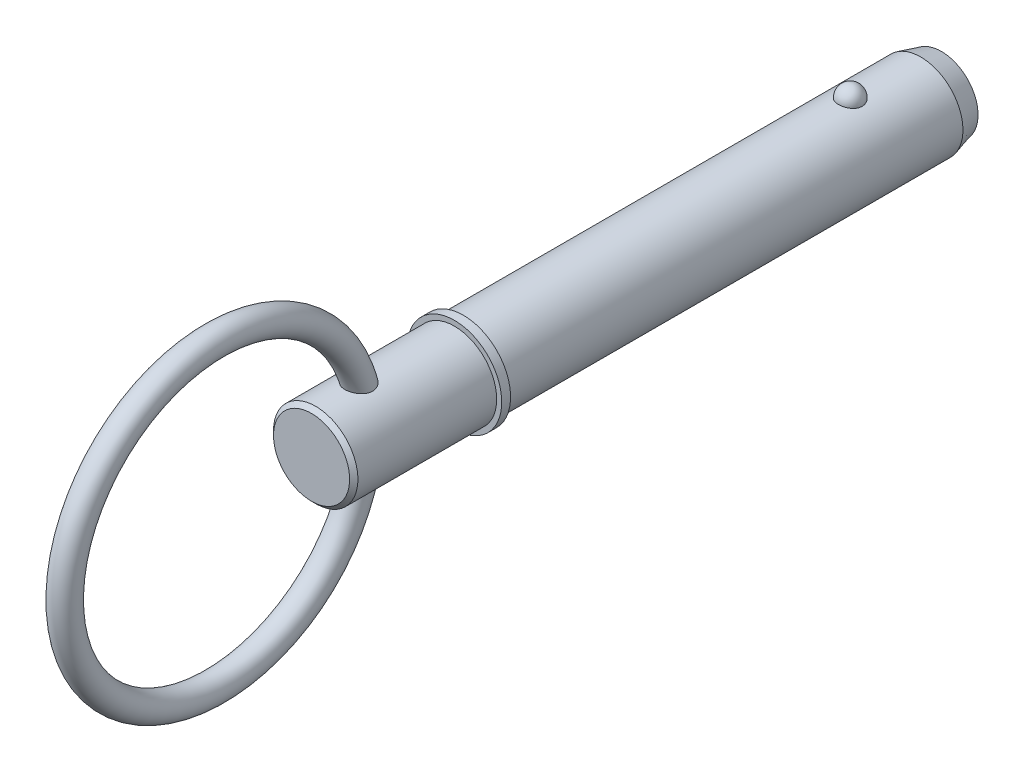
ISO-10303-21;
HEADER;
FILE_DESCRIPTION(('STEP AP214'),'2;1');
FILE_NAME('part.step','',(''),(''),'','','');
FILE_SCHEMA(('AUTOMOTIVE_DESIGN { 1 0 10303 214 1 1 1 1 }'));
ENDSEC;
DATA;
#1=APPLICATION_CONTEXT('core data for automotive mechanical design processes');
#2=APPLICATION_PROTOCOL_DEFINITION('international standard','automotive_design',2000,#1);
#3=PRODUCT_CONTEXT('',#1,'mechanical');
#4=PRODUCT('Part','Part','',(#3));
#5=PRODUCT_RELATED_PRODUCT_CATEGORY('part','',(#4));
#6=PRODUCT_DEFINITION_FORMATION('','',#4);
#7=PRODUCT_DEFINITION_CONTEXT('part definition',#1,'design');
#8=PRODUCT_DEFINITION('design','',#6,#7);
#9=PRODUCT_DEFINITION_SHAPE('','',#8);
#10=(LENGTH_UNIT() NAMED_UNIT(*) SI_UNIT(.MILLI.,.METRE.));
#11=(NAMED_UNIT(*) PLANE_ANGLE_UNIT() SI_UNIT($,.RADIAN.));
#12=(NAMED_UNIT(*) SI_UNIT($,.STERADIAN.) SOLID_ANGLE_UNIT());
#13=UNCERTAINTY_MEASURE_WITH_UNIT(LENGTH_MEASURE(1.E-05),#10,'distance_accuracy_value','');
#14=(GEOMETRIC_REPRESENTATION_CONTEXT(3) GLOBAL_UNCERTAINTY_ASSIGNED_CONTEXT((#13)) GLOBAL_UNIT_ASSIGNED_CONTEXT((#10,
#11,#12)) REPRESENTATION_CONTEXT('',''));
#15=CARTESIAN_POINT('',(0.,0.,0.));
#16=DIRECTION('',(0.,0.,1.));
#17=DIRECTION('',(1.,0.,0.));
#18=AXIS2_PLACEMENT_3D('',#15,#16,#17);
#19=CARTESIAN_POINT('',(0.,0.,63.5));
#20=DIRECTION('',(0.,0.,-1.));
#21=DIRECTION('',(-1.,0.,0.));
#22=AXIS2_PLACEMENT_3D('',#19,#20,#21);
#23=CYLINDRICAL_SURFACE('',#22,7.145);
#24=CARTESIAN_POINT('',(1.99971637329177,6.85945766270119,-2.02));
#25=CARTESIAN_POINT('',(1.9997145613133,6.85945924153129,-1.9070973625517));
#26=CARTESIAN_POINT('',(1.99051486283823,6.86216053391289,-1.79417185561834));
#27=CARTESIAN_POINT('',(1.95393597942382,6.87266409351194,-1.57152267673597));
#28=CARTESIAN_POINT('',(1.92655029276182,6.88046818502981,-1.46180016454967));
#29=CARTESIAN_POINT('',(1.85429435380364,6.90029063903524,-1.24873107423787));
#30=CARTESIAN_POINT('',(1.80943177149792,6.91230715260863,-1.14538172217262));
#31=CARTESIAN_POINT('',(1.70333474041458,6.93921158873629,-0.947875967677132));
#32=CARTESIAN_POINT('',(1.64210059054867,6.95409945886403,-0.85371939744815));
#33=CARTESIAN_POINT('',(1.5044381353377,6.98517577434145,-0.676721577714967));
#34=CARTESIAN_POINT('',(1.42793505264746,7.00137037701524,-0.593939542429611));
#35=CARTESIAN_POINT('',(1.26189697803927,7.03319066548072,-0.442536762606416));
#36=CARTESIAN_POINT('',(1.17236198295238,7.04881635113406,-0.373916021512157));
#37=CARTESIAN_POINT('',(0.982932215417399,7.0777121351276,-0.252935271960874));
#38=CARTESIAN_POINT('',(0.883068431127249,7.09098897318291,-0.200528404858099));
#39=CARTESIAN_POINT('',(0.675560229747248,7.11375589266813,-0.113212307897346));
#40=CARTESIAN_POINT('',(0.567916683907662,7.12324639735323,-0.078301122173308));
#41=CARTESIAN_POINT('',(0.350006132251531,7.13724173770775,-0.0274707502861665));
#42=CARTESIAN_POINT('',(0.239822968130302,7.14183447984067,-0.0112162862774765));
#43=CARTESIAN_POINT('',(0.0181946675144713,7.14583597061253,0.00296794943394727));
#44=CARTESIAN_POINT('',(-0.0932503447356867,7.14524522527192,0.000899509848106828));
#45=CARTESIAN_POINT('',(-0.312527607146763,7.13899247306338,-0.0213331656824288));
#46=CARTESIAN_POINT('',(-0.420388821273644,7.13340426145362,-0.0412340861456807));
#47=CARTESIAN_POINT('',(-0.631141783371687,7.11785474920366,-0.0982040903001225));
#48=CARTESIAN_POINT('',(-0.734033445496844,7.10789337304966,-0.13527347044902));
#49=CARTESIAN_POINT('',(-0.932634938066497,7.08458058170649,-0.225826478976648));
#50=CARTESIAN_POINT('',(-1.02829911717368,7.07120963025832,-0.279405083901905));
#51=CARTESIAN_POINT('',(-1.20927180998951,7.04252043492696,-0.401457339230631));
#52=CARTESIAN_POINT('',(-1.29457925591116,7.02720199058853,-0.469932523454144));
#53=CARTESIAN_POINT('',(-1.45423311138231,6.995926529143,-0.62143818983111));
#54=CARTESIAN_POINT('',(-1.5283348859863,6.97996288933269,-0.704725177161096));
#55=CARTESIAN_POINT('',(-1.66169281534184,6.94942414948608,-0.882667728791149));
#56=CARTESIAN_POINT('',(-1.72094789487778,6.93484915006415,-0.977324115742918));
#57=CARTESIAN_POINT('',(-1.82375276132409,6.90853186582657,-1.17661373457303));
#58=CARTESIAN_POINT('',(-1.86711024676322,6.8968248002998,-1.28135093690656));
#59=CARTESIAN_POINT('',(-1.9360425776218,6.87779420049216,-1.49689986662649));
#60=CARTESIAN_POINT('',(-1.96161794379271,6.87047053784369,-1.60771141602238));
#61=CARTESIAN_POINT('',(-1.99427437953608,6.86106309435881,-1.83176258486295));
#62=CARTESIAN_POINT('',(-2.00143373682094,6.8589571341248,-1.9449898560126));
#63=CARTESIAN_POINT('',(-1.99730449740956,6.86016064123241,-2.17107603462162));
#64=CARTESIAN_POINT('',(-1.98601641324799,6.86346995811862,-2.28393495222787));
#65=CARTESIAN_POINT('',(-1.94538181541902,6.87509649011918,-2.5054843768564));
#66=CARTESIAN_POINT('',(-1.91612773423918,6.88338806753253,-2.61419321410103));
#67=CARTESIAN_POINT('',(-1.84036449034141,6.90402888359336,-2.8250124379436));
#68=CARTESIAN_POINT('',(-1.79385462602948,6.91637828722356,-2.92712255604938));
#69=CARTESIAN_POINT('',(-1.68442067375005,6.94384180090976,-3.12247704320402));
#70=CARTESIAN_POINT('',(-1.62140729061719,6.95897081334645,-3.21566929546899));
#71=CARTESIAN_POINT('',(-1.4806650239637,6.99026742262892,-3.38999412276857));
#72=CARTESIAN_POINT('',(-1.40293556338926,7.00643506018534,-3.47112622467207));
#73=CARTESIAN_POINT('',(-1.2344320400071,7.03807960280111,-3.61938672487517));
#74=CARTESIAN_POINT('',(-1.1436092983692,7.05355363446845,-3.68646046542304));
#75=CARTESIAN_POINT('',(-0.9515914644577,7.08201263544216,-3.80431973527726));
#76=CARTESIAN_POINT('',(-0.850397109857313,7.09499778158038,-3.85510642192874));
#77=CARTESIAN_POINT('',(-0.641823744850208,7.11687679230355,-3.93839532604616));
#78=CARTESIAN_POINT('',(-0.534539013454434,7.1258202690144,-3.97112042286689));
#79=CARTESIAN_POINT('',(-0.315743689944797,7.1388605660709,-4.01830716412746));
#80=CARTESIAN_POINT('',(-0.204233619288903,7.14295798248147,-4.0327710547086));
#81=CARTESIAN_POINT('',(0.0175518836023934,7.14582273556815,-4.04291389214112));
#82=CARTESIAN_POINT('',(0.127809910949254,7.14469090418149,-4.03894819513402));
#83=CARTESIAN_POINT('',(0.346044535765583,7.13745046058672,-4.01315850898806));
#84=CARTESIAN_POINT('',(0.454021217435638,7.13134203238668,-3.99133518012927));
#85=CARTESIAN_POINT('',(0.664227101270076,7.11483713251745,-3.93057164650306));
#86=CARTESIAN_POINT('',(0.766477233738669,7.10445761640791,-3.89169908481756));
#87=CARTESIAN_POINT('',(0.96292921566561,7.08050813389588,-3.79792023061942));
#88=CARTESIAN_POINT('',(1.05713054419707,7.06693796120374,-3.7430129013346));
#89=CARTESIAN_POINT('',(1.23644031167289,7.03780007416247,-3.61765173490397));
#90=CARTESIAN_POINT('',(1.32138387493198,7.0222044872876,-3.54696861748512));
#91=CARTESIAN_POINT('',(1.47830582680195,6.99085504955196,-3.39245228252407));
#92=CARTESIAN_POINT('',(1.55028198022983,6.97510117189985,-3.30861680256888));
#93=CARTESIAN_POINT('',(1.68063701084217,6.94485803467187,-3.12843058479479));
#94=CARTESIAN_POINT('',(1.73875175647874,6.93039619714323,-3.03188405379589));
#95=CARTESIAN_POINT('',(1.83823393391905,6.90467783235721,-2.83015210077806));
#96=CARTESIAN_POINT('',(1.87960712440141,6.89342020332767,-2.72496966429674));
#97=CARTESIAN_POINT('',(1.94111647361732,6.87633596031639,-2.52050234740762));
#98=CARTESIAN_POINT('',(1.96305249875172,6.87005682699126,-2.42179225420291));
#99=CARTESIAN_POINT('',(1.99235308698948,6.86161702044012,-2.22206084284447));
#100=CARTESIAN_POINT('',(1.99971799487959,6.85945624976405,-2.12103957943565));
#101=CARTESIAN_POINT('',(1.99971637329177,6.85945766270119,-2.02));
#102=B_SPLINE_CURVE_WITH_KNOTS('',3,(#24,#25,#26,#27,#28,#29,#30,#31,#32,#33,#34,#35,#36,#37,
#38,#39,#40,#41,#42,#43,#44,#45,#46,#47,#48,#49,#50,#51,#52,#53,#54,#55,#56,#57,#58,#59,#60,#61,
#62,#63,#64,#65,#66,#67,#68,#69,#70,#71,#72,#73,#74,#75,#76,#77,#78,#79,#80,#81,#82,#83,#84,#85,
#86,#87,#88,#89,#90,#91,#92,#93,#94,#95,#96,#97,#98,#99,#100,#101),.UNSPECIFIED.,.T.,.F.,(4,2,2,
2,2,2,2,2,2,2,2,2,2,2,2,2,2,2,2,2,2,2,2,2,2,2,2,2,2,2,2,2,2,2,2,2,2,2,4),(0.,0.338345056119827,
0.67681114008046,1.01512885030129,1.35344038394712,1.69345130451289,2.0334623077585,
2.37248128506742,2.71146235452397,3.04425125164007,3.37700766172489,3.70493009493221,
4.03285819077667,4.36270921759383,4.69259422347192,5.02887632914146,5.36518278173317,
5.70543263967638,6.04567253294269,6.38446363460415,6.72324532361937,7.0602984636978,
7.39736530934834,7.73629500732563,8.07523799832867,8.4154752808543,8.7556883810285,
9.09160363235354,9.42747756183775,9.75690239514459,10.0863150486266,10.4144324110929,
10.7425709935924,11.0758313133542,11.4091490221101,11.748385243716,12.0875046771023,
12.3903058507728,12.6930998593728),.UNSPECIFIED.);
#103=CARTESIAN_POINT('',(1.99971637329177,6.85945766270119,-2.02));
#104=VERTEX_POINT('',#103);
#105=EDGE_CURVE('E101',#104,#104,#102,.T.);
#106=ORIENTED_EDGE('',*,*,#105,.T.);
#107=EDGE_LOOP('',(#106));
#108=FACE_BOUND('',#107,.T.);
#109=CARTESIAN_POINT('',(0.,0.,-13.9499999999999));
#110=DIRECTION('',(0.,0.,-1.));
#111=DIRECTION('',(-1.,0.,0.));
#112=AXIS2_PLACEMENT_3D('',#109,#110,#111);
#113=CIRCLE('',#112,7.145);
#114=CARTESIAN_POINT('',(-7.145,0.,-13.9499999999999));
#115=VERTEX_POINT('',#114);
#116=EDGE_CURVE('E109',#115,#115,#113,.F.);
#117=ORIENTED_EDGE('',*,*,#116,.T.);
#118=EDGE_LOOP('',(#117));
#119=FACE_BOUND('',#118,.T.);
#120=CARTESIAN_POINT('',(0.,0.,63.5));
#121=DIRECTION('',(0.,0.,1.));
#122=DIRECTION('',(1.,0.,0.));
#123=AXIS2_PLACEMENT_3D('',#120,#121,#122);
#124=CIRCLE('',#123,7.145);
#125=CARTESIAN_POINT('',(7.145,0.,63.5));
#126=VERTEX_POINT('',#125);
#127=EDGE_CURVE('E107',#126,#126,#124,.T.);
#128=ORIENTED_EDGE('',*,*,#127,.F.);
#129=EDGE_LOOP('',(#128));
#130=FACE_BOUND('',#129,.T.);
#131=ADVANCED_FACE('F39',(#108,#119,#130),#23,.T.);
#132=CARTESIAN_POINT('',(0.,0.,-17.45));
#133=DIRECTION('',(0.,0.,-1.));
#134=DIRECTION('',(-1.,0.,0.));
#135=AXIS2_PLACEMENT_3D('',#132,#133,#134);
#136=PLANE('',#135);
#137=CARTESIAN_POINT('',(0.,0.,-17.45));
#138=DIRECTION('',(0.,0.,-1.));
#139=DIRECTION('',(-1.,0.,0.));
#140=AXIS2_PLACEMENT_3D('',#137,#138,#139);
#141=CIRCLE('',#140,6.20717782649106);
#142=CARTESIAN_POINT('',(-6.20717782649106,0.,-17.45));
#143=VERTEX_POINT('',#142);
#144=EDGE_CURVE('E143',#143,#143,#141,.T.);
#145=ORIENTED_EDGE('',*,*,#144,.T.);
#146=EDGE_LOOP('',(#145));
#147=FACE_BOUND('',#146,.T.);
#148=ADVANCED_FACE('F87',(#147),#136,.T.);
#149=CARTESIAN_POINT('',(0.,0.,-17.45));
#150=DIRECTION('',(0.,0.,1.));
#151=DIRECTION('',(1.,0.,0.));
#152=AXIS2_PLACEMENT_3D('',#149,#150,#151);
#153=CONICAL_SURFACE('',#152,6.20717782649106,0.261799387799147);
#154=ORIENTED_EDGE('',*,*,#116,.F.);
#155=EDGE_LOOP('',(#154));
#156=FACE_BOUND('',#155,.T.);
#157=ORIENTED_EDGE('',*,*,#144,.F.);
#158=EDGE_LOOP('',(#157));
#159=FACE_BOUND('',#158,.T.);
#160=ADVANCED_FACE('F93',(#156,#159),#153,.T.);
#161=CARTESIAN_POINT('',(0.,7.145,-2.02));
#162=DIRECTION('',(0.,1.,0.));
#163=DIRECTION('',(0.,0.,1.));
#164=AXIS2_PLACEMENT_3D('',#161,#162,#163);
#165=SPHERICAL_SURFACE('',#164,2.02);
#166=ORIENTED_EDGE('',*,*,#105,.F.);
#167=EDGE_LOOP('',(#166));
#168=FACE_BOUND('',#167,.T.);
#169=ADVANCED_FACE('F112',(#168),#165,.T.);
#170=CARTESIAN_POINT('',(0.,0.,63.5));
#171=DIRECTION('',(0.,0.,-1.));
#172=DIRECTION('',(-1.,0.,0.));
#173=AXIS2_PLACEMENT_3D('',#170,#171,#172);
#174=PLANE('',#173);
#175=ORIENTED_EDGE('',*,*,#127,.T.);
#176=EDGE_LOOP('',(#175));
#177=FACE_BOUND('',#176,.T.);
#178=CARTESIAN_POINT('',(0.,0.,63.5));
#179=DIRECTION('',(0.,0.,-1.));
#180=DIRECTION('',(-1.,0.,0.));
#181=AXIS2_PLACEMENT_3D('',#178,#179,#180);
#182=CIRCLE('',#181,8.);
#183=CARTESIAN_POINT('',(-8.,0.,63.5));
#184=VERTEX_POINT('',#183);
#185=EDGE_CURVE('E108',#184,#184,#182,.T.);
#186=ORIENTED_EDGE('',*,*,#185,.T.);
#187=EDGE_LOOP('',(#186));
#188=FACE_BOUND('',#187,.T.);
#189=ADVANCED_FACE('F116',(#177,#188),#174,.T.);
#190=CARTESIAN_POINT('',(0.,0.,33.7287874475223));
#191=DIRECTION('',(0.,0.,-1.));
#192=DIRECTION('',(-1.,0.,0.));
#193=AXIS2_PLACEMENT_3D('',#190,#191,#192);
#194=CYLINDRICAL_SURFACE('',#193,8.);
#195=CARTESIAN_POINT('',(0.,0.,65.));
#196=DIRECTION('',(0.,0.,-1.));
#197=DIRECTION('',(-1.,0.,0.));
#198=AXIS2_PLACEMENT_3D('',#195,#196,#197);
#199=CIRCLE('',#198,8.);
#200=CARTESIAN_POINT('',(-8.,0.,65.));
#201=VERTEX_POINT('',#200);
#202=EDGE_CURVE('E133',#201,#201,#199,.T.);
#203=ORIENTED_EDGE('',*,*,#202,.T.);
#204=EDGE_LOOP('',(#203));
#205=FACE_BOUND('',#204,.T.);
#206=ORIENTED_EDGE('',*,*,#185,.F.);
#207=EDGE_LOOP('',(#206));
#208=FACE_BOUND('',#207,.T.);
#209=ADVANCED_FACE('F120',(#205,#208),#194,.T.);
#210=CARTESIAN_POINT('',(0.,8.,65.));
#211=DIRECTION('',(0.,0.,1.));
#212=DIRECTION('',(1.,0.,0.));
#213=AXIS2_PLACEMENT_3D('',#210,#211,#212);
#214=PLANE('',#213);
#215=CARTESIAN_POINT('',(0.,0.,65.));
#216=DIRECTION('',(0.,0.,1.));
#217=DIRECTION('',(1.,0.,0.));
#218=AXIS2_PLACEMENT_3D('',#215,#216,#217);
#219=CIRCLE('',#218,7.145);
#220=CARTESIAN_POINT('',(7.145,0.,65.));
#221=VERTEX_POINT('',#220);
#222=EDGE_CURVE('E111',#221,#221,#219,.T.);
#223=ORIENTED_EDGE('',*,*,#222,.F.);
#224=EDGE_LOOP('',(#223));
#225=FACE_BOUND('',#224,.T.);
#226=ORIENTED_EDGE('',*,*,#202,.F.);
#227=EDGE_LOOP('',(#226));
#228=FACE_BOUND('',#227,.T.);
#229=ADVANCED_FACE('F84',(#225,#228),#214,.T.);
#230=CARTESIAN_POINT('',(0.,0.,89.2));
#231=DIRECTION('',(0.,0.,-1.));
#232=DIRECTION('',(-1.,0.,0.));
#233=AXIS2_PLACEMENT_3D('',#230,#231,#232);
#234=CYLINDRICAL_SURFACE('',#233,7.145);
#235=CARTESIAN_POINT('',(-1.03551034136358,-7.0695645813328,79.1302593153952));
#236=CARTESIAN_POINT('',(-0.923225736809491,-7.08601142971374,79.0744028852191));
#237=CARTESIAN_POINT('',(-0.806039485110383,-7.10042113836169,79.0278354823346));
#238=CARTESIAN_POINT('',(-0.565173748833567,-7.1236385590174,78.9542799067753));
#239=CARTESIAN_POINT('',(-0.441495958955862,-7.13244772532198,78.9272866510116));
#240=CARTESIAN_POINT('',(-0.191106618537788,-7.14354309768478,78.8934505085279));
#241=CARTESIAN_POINT('',(-0.0643945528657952,-7.14582818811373,78.886611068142));
#242=CARTESIAN_POINT('',(0.188443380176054,-7.14363337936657,78.8932414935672));
#243=CARTESIAN_POINT('',(0.314569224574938,-7.13915321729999,78.906712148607));
#244=CARTESIAN_POINT('',(0.562499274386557,-7.12390574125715,78.9536416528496));
#245=CARTESIAN_POINT('',(0.684308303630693,-7.11314569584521,78.9870773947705));
#246=CARTESIAN_POINT('',(0.920329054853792,-7.08647538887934,79.073194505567));
#247=CARTESIAN_POINT('',(1.03454038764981,-7.07056486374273,79.1258768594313));
#248=CARTESIAN_POINT('',(1.25232634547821,-7.03526161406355,79.2494470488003));
#249=CARTESIAN_POINT('',(1.35588248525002,-7.01586299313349,79.3203658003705));
#250=CARTESIAN_POINT('',(1.54916093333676,-6.9757352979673,79.4787573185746));
#251=CARTESIAN_POINT('',(1.63888414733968,-6.95500631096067,79.5662290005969));
#252=CARTESIAN_POINT('',(1.80113983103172,-6.91475703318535,79.7547277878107));
#253=CARTESIAN_POINT('',(1.8738192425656,-6.89522757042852,79.8556263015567));
#254=CARTESIAN_POINT('',(2.00091178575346,-6.85942834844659,80.06884010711));
#255=CARTESIAN_POINT('',(2.05532963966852,-6.8431577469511,80.1811524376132));
#256=CARTESIAN_POINT('',(2.14350100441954,-6.81604873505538,80.4111948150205));
#257=CARTESIAN_POINT('',(2.17770329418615,-6.80509340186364,80.5287395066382));
#258=CARTESIAN_POINT('',(2.22691394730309,-6.7891497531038,80.768149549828));
#259=CARTESIAN_POINT('',(2.2419216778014,-6.7841616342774,80.8900150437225));
#260=CARTESIAN_POINT('',(2.25313992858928,-6.78044381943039,81.1358069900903));
#261=CARTESIAN_POINT('',(2.24917302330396,-6.78177319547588,81.2597420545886));
#262=CARTESIAN_POINT('',(2.22301329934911,-6.79039131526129,81.5054389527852));
#263=CARTESIAN_POINT('',(2.20081491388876,-6.79768187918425,81.6272001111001));
#264=CARTESIAN_POINT('',(2.13702421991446,-6.81801706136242,81.8752873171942));
#265=CARTESIAN_POINT('',(2.09404815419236,-6.83146790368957,82.0012230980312));
#266=CARTESIAN_POINT('',(1.9898638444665,-6.86253672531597,82.2448244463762));
#267=CARTESIAN_POINT('',(1.9286413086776,-6.88015796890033,82.3624834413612));
#268=CARTESIAN_POINT('',(1.78274362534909,-6.91947130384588,82.5974979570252));
#269=CARTESIAN_POINT('',(1.69640701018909,-6.94139021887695,82.7137892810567));
#270=CARTESIAN_POINT('',(1.50503944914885,-6.98537683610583,82.9297996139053));
#271=CARTESIAN_POINT('',(1.40001969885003,-7.00744444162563,83.029528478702));
#272=CARTESIAN_POINT('',(1.19221781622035,-7.04548349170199,83.193170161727));
#273=CARTESIAN_POINT('',(1.09203347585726,-7.06185586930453,83.2602859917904));
#274=CARTESIAN_POINT('',(0.881607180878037,-7.09119477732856,83.377337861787));
#275=CARTESIAN_POINT('',(0.771372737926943,-7.10416382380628,83.4272866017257));
#276=CARTESIAN_POINT('',(0.542622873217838,-7.12529560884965,83.507475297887));
#277=CARTESIAN_POINT('',(0.424058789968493,-7.13342692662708,83.5375865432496));
#278=CARTESIAN_POINT('',(0.18315568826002,-7.14366628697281,83.5753706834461));
#279=CARTESIAN_POINT('',(0.0608191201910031,-7.14577815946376,83.583057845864));
#280=CARTESIAN_POINT('',(-0.169367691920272,-7.14381572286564,83.5758601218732));
#281=CARTESIAN_POINT('',(-0.277308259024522,-7.14040669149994,83.5634029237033));
#282=CARTESIAN_POINT('',(-0.489468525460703,-7.12900651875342,83.5211569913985));
#283=CARTESIAN_POINT('',(-0.593687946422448,-7.12101503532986,83.4913669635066));
#284=CARTESIAN_POINT('',(-0.796149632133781,-7.10123695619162,83.4159872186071));
#285=CARTESIAN_POINT('',(-0.894373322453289,-7.08943921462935,83.3703510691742));
#286=CARTESIAN_POINT('',(-1.08274371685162,-7.06312621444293,83.265336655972));
#287=CARTESIAN_POINT('',(-1.17288754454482,-7.04860999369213,83.2059535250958));
#288=CARTESIAN_POINT('',(-1.35484961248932,-7.01605385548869,83.0671134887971));
#289=CARTESIAN_POINT('',(-1.44541008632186,-6.99780069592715,82.9860611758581));
#290=CARTESIAN_POINT('',(-1.61364655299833,-6.96093393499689,82.8115990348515));
#291=CARTESIAN_POINT('',(-1.69131381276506,-6.94232009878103,82.7181809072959));
#292=CARTESIAN_POINT('',(-1.843300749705,-6.90364386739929,82.5066087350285));
#293=CARTESIAN_POINT('',(-1.9154309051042,-6.88377370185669,82.3868392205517));
#294=CARTESIAN_POINT('',(-2.04002946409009,-6.84788436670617,82.1368759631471));
#295=CARTESIAN_POINT('',(-2.09248830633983,-6.83186707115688,82.0066771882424));
#296=CARTESIAN_POINT('',(-2.17795964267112,-6.80511869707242,81.7325553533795));
#297=CARTESIAN_POINT('',(-2.20992909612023,-6.79467512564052,81.5882740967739));
#298=CARTESIAN_POINT('',(-2.24813111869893,-6.78213595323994,81.2959843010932));
#299=CARTESIAN_POINT('',(-2.25438316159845,-6.78003403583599,81.1479786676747));
#300=CARTESIAN_POINT('',(-2.24011368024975,-6.78475868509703,80.8654300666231));
#301=CARTESIAN_POINT('',(-2.22172362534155,-6.79087455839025,80.7307692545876));
#302=CARTESIAN_POINT('',(-2.16145328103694,-6.81029672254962,80.4673673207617));
#303=CARTESIAN_POINT('',(-2.11958615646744,-6.82359898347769,80.3386229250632));
#304=CARTESIAN_POINT('',(-2.0178412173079,-6.85433303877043,80.1022679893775));
#305=CARTESIAN_POINT('',(-1.95982394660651,-6.87131080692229,79.9937922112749));
#306=CARTESIAN_POINT('',(-1.82642155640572,-6.90796511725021,79.7885914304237));
#307=CARTESIAN_POINT('',(-1.75103235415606,-6.92764229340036,79.6918691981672));
#308=CARTESIAN_POINT('',(-1.57825515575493,-6.96911949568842,79.5054086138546));
#309=CARTESIAN_POINT('',(-1.47957996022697,-6.99096237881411,79.4168703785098));
#310=CARTESIAN_POINT('',(-1.26760341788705,-7.0324852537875,79.2588404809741));
#311=CARTESIAN_POINT('',(-1.15429989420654,-7.05216492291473,79.1893516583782));
#312=CARTESIAN_POINT('',(-1.03551034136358,-7.0695645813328,79.1302593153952));
#313=B_SPLINE_CURVE_WITH_KNOTS('',3,(#235,#236,#237,#238,#239,#240,#241,#242,#243,#244,#245,
#246,#247,#248,#249,#250,#251,#252,#253,#254,#255,#256,#257,#258,#259,#260,#261,#262,#263,#264,
#265,#266,#267,#268,#269,#270,#271,#272,#273,#274,#275,#276,#277,#278,#279,#280,#281,#282,#283,
#284,#285,#286,#287,#288,#289,#290,#291,#292,#293,#294,#295,#296,#297,#298,#299,#300,#301,#302,
#303,#304,#305,#306,#307,#308,#309,#310,#311,#312),.UNSPECIFIED.,.T.,.F.,(4,2,2,2,2,2,2,2,2,2,2,
2,2,2,2,2,2,2,2,2,2,2,2,2,2,2,2,2,2,2,2,2,2,2,2,2,2,2,4),(0.,0.378979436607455,
0.757860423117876,1.13680619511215,1.51576669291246,1.89428943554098,2.2728315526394,
2.65201969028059,3.03118299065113,3.4069461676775,3.78261210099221,4.14959041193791,
4.5165808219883,4.88700951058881,5.25755134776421,5.65713708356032,6.05703662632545,
6.49445595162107,6.93161403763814,7.29520224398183,7.65852089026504,8.02417421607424,
8.38959483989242,8.71415763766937,9.0387446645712,9.36429093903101,9.68995264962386,
10.0572255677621,10.4247462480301,10.8465602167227,11.2685789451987,11.7106604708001,
12.152407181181,12.5583067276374,12.9639788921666,13.3347314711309,13.7055712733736,
14.1064462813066,14.5073810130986),.UNSPECIFIED.);
#314=CARTESIAN_POINT('',(-1.03551034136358,-7.0695645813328,79.1302593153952));
#315=VERTEX_POINT('',#314);
#316=EDGE_CURVE('E10',#315,#315,#313,.T.);
#317=ORIENTED_EDGE('',*,*,#316,.F.);
#318=EDGE_LOOP('',(#317));
#319=FACE_BOUND('',#318,.T.);
#320=CARTESIAN_POINT('',(-1.03551034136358,7.0695645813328,79.1302593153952));
#321=CARTESIAN_POINT('',(-1.14644953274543,7.0533145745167,79.185446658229));
#322=CARTESIAN_POINT('',(-1.25260902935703,7.03507806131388,79.2497022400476));
#323=CARTESIAN_POINT('',(-1.45240021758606,6.99656564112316,79.3949589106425));
#324=CARTESIAN_POINT('',(-1.54602879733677,6.97628922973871,79.4759641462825));
#325=CARTESIAN_POINT('',(-1.71815091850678,6.93590796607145,79.6529100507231));
#326=CARTESIAN_POINT('',(-1.79663177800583,6.91580327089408,79.7488631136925));
#327=CARTESIAN_POINT('',(-1.93607718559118,6.87807159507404,79.9531625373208));
#328=CARTESIAN_POINT('',(-1.99704642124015,6.86044395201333,80.0615055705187));
#329=CARTESIAN_POINT('',(-2.09894945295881,6.82995115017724,80.2855428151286));
#330=CARTESIAN_POINT('',(-2.1402125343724,6.81700866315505,80.4010768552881));
#331=CARTESIAN_POINT('',(-2.20347311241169,6.79682602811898,80.6377588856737));
#332=CARTESIAN_POINT('',(-2.22547114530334,6.78958572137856,80.7589067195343));
#333=CARTESIAN_POINT('',(-2.25026114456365,6.78140983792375,81.0032142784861));
#334=CARTESIAN_POINT('',(-2.25306986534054,6.78046876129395,81.1263721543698));
#335=CARTESIAN_POINT('',(-2.2403056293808,6.78469532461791,81.3716049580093));
#336=CARTESIAN_POINT('',(-2.22472720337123,6.78986478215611,81.4936795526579));
#337=CARTESIAN_POINT('',(-2.17472134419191,6.8060520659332,81.7420367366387));
#338=CARTESIAN_POINT('',(-2.13910164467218,6.81743831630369,81.8680537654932));
#339=CARTESIAN_POINT('',(-2.04975058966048,6.84483151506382,82.1129736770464));
#340=CARTESIAN_POINT('',(-1.99600968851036,6.86084089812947,82.2318727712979));
#341=CARTESIAN_POINT('',(-1.86558545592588,6.8975101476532,82.4714258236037));
#342=CARTESIAN_POINT('',(-1.78715729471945,6.91847353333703,82.5910877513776));
#343=CARTESIAN_POINT('',(-1.61149373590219,6.96148580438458,82.8156460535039));
#344=CARTESIAN_POINT('',(-1.51424701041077,6.98353533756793,82.9205334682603));
#345=CARTESIAN_POINT('',(-1.30107590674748,7.02639179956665,83.1129518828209));
#346=CARTESIAN_POINT('',(-1.18492282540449,7.04717858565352,83.2002366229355));
#347=CARTESIAN_POINT('',(-0.937392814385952,7.08434208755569,83.3508275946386));
#348=CARTESIAN_POINT('',(-0.806039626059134,7.10072555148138,83.4141705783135));
#349=CARTESIAN_POINT('',(-0.550470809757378,7.12475629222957,83.5054837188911));
#350=CARTESIAN_POINT('',(-0.427643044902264,7.13327781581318,83.5370470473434));
#351=CARTESIAN_POINT('',(-0.240556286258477,7.14122488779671,83.5663563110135));
#352=CARTESIAN_POINT('',(-0.177714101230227,7.14306799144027,83.5731199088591));
#353=CARTESIAN_POINT('',(-0.0516470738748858,7.14509121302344,83.5805390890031));
#354=CARTESIAN_POINT('',(0.0115777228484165,7.14527152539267,83.5811953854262));
#355=CARTESIAN_POINT('',(0.182932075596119,7.14347436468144,83.5746165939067));
#356=CARTESIAN_POINT('',(0.290871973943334,7.13986325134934,83.5614086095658));
#357=CARTESIAN_POINT('',(0.502842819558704,7.1280769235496,83.5176904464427));
#358=CARTESIAN_POINT('',(0.606873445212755,7.11990133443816,83.4871788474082));
#359=CARTESIAN_POINT('',(0.809001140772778,7.09978218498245,83.4103786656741));
#360=CARTESIAN_POINT('',(0.907071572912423,7.08782300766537,83.3640246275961));
#361=CARTESIAN_POINT('',(1.09503957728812,7.0612282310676,83.2576208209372));
#362=CARTESIAN_POINT('',(1.18493426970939,7.04659169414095,83.1975662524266));
#363=CARTESIAN_POINT('',(1.36644041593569,7.01380352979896,83.0572339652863));
#364=CARTESIAN_POINT('',(1.45676563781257,6.99544216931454,82.9753442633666));
#365=CARTESIAN_POINT('',(1.6244063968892,6.95842750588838,82.7992310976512));
#366=CARTESIAN_POINT('',(1.70171298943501,6.93977401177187,82.7049992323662));
#367=CARTESIAN_POINT('',(1.85271606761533,6.90111647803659,82.4918074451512));
#368=CARTESIAN_POINT('',(1.92421731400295,6.88131605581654,82.3712480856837));
#369=CARTESIAN_POINT('',(2.04739198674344,6.84567995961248,82.1197850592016));
#370=CARTESIAN_POINT('',(2.0990562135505,6.82984612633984,81.9888766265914));
#371=CARTESIAN_POINT('',(2.1825776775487,6.80363167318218,81.7138472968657));
#372=CARTESIAN_POINT('',(2.21345394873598,6.79352430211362,81.5693978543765));
#373=CARTESIAN_POINT('',(2.24941288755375,6.78170753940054,81.2769846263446));
#374=CARTESIAN_POINT('',(2.2545156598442,6.77999160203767,81.1290236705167));
#375=CARTESIAN_POINT('',(2.2380435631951,6.78544298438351,80.8470530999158));
#376=CARTESIAN_POINT('',(2.21864521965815,6.79188566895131,80.7129037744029));
#377=CARTESIAN_POINT('',(2.15648766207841,6.81187529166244,80.4506903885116));
#378=CARTESIAN_POINT('',(2.11373989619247,6.82541874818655,80.3226233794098));
#379=CARTESIAN_POINT('',(2.01040099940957,6.85652522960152,80.0875077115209));
#380=CARTESIAN_POINT('',(1.9516260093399,6.87365110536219,79.9795975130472));
#381=CARTESIAN_POINT('',(1.81683142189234,6.91050025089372,79.7756496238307));
#382=CARTESIAN_POINT('',(1.74081238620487,6.93022343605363,79.6796115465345));
#383=CARTESIAN_POINT('',(1.57431234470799,6.96992220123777,79.5025418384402));
#384=CARTESIAN_POINT('',(1.48394688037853,6.98989467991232,79.421400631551));
#385=CARTESIAN_POINT('',(1.29081365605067,7.02812243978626,79.2750381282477));
#386=CARTESIAN_POINT('',(1.18804491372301,7.04637758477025,79.2098180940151));
#387=CARTESIAN_POINT('',(0.970386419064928,7.07967210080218,79.0953776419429));
#388=CARTESIAN_POINT('',(0.855272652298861,7.09462807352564,79.0465586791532));
#389=CARTESIAN_POINT('',(0.618143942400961,7.11920826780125,78.9680711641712));
#390=CARTESIAN_POINT('',(0.496128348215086,7.12883198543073,78.9384044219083));
#391=CARTESIAN_POINT('',(0.247581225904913,7.14180209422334,78.8986987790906));
#392=CARTESIAN_POINT('',(0.12102076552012,7.14509609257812,78.8888236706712));
#393=CARTESIAN_POINT('',(-0.132022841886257,7.14489967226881,78.8894154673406));
#394=CARTESIAN_POINT('',(-0.258506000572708,7.14141109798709,78.8998768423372));
#395=CARTESIAN_POINT('',(-0.496649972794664,7.12862600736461,78.9390533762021));
#396=CARTESIAN_POINT('',(-0.608625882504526,7.11987587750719,78.9660553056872));
#397=CARTESIAN_POINT('',(-0.826925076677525,7.09783467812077,79.0362228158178));
#398=CARTESIAN_POINT('',(-0.933248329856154,7.08454358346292,79.0793884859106));
#399=CARTESIAN_POINT('',(-1.03551034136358,7.0695645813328,79.1302593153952));
#400=B_SPLINE_CURVE_WITH_KNOTS('',3,(#320,#321,#322,#323,#324,#325,#326,#327,#328,#329,#330,
#331,#332,#333,#334,#335,#336,#337,#338,#339,#340,#341,#342,#343,#344,#345,#346,#347,#348,#349,
#350,#351,#352,#353,#354,#355,#356,#357,#358,#359,#360,#361,#362,#363,#364,#365,#366,#367,#368,
#369,#370,#371,#372,#373,#374,#375,#376,#377,#378,#379,#380,#381,#382,#383,#384,#385,#386,#387,
#388,#389,#390,#391,#392,#393,#394,#395,#396,#397,#398,#399),.UNSPECIFIED.,.T.,.F.,(4,2,2,2,2,2,
2,2,2,2,2,2,2,2,2,2,2,2,2,2,2,2,2,2,2,2,2,2,2,2,2,2,2,2,2,2,2,2,2,4),(0.,0.374504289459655,
0.749101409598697,1.12401080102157,1.49881974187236,1.86712525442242,2.23542051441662,
2.60339417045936,2.97147730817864,3.36420696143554,3.75714381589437,4.18898920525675,
4.62109535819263,5.05888124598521,5.49599234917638,5.87475353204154,6.0641680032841,
6.25356032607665,6.57826179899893,6.90298992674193,7.22907626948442,7.55527703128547,
7.92373585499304,8.29244681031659,8.71527472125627,9.13829848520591,9.58009907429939,
10.0215549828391,10.4264139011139,10.831074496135,11.2014904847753,11.571894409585,
11.9394538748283,12.3070424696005,12.6830655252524,13.0591241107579,13.4382822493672,
13.8173372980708,14.1625475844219,14.5077597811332),.UNSPECIFIED.);
#401=CARTESIAN_POINT('',(-1.03551034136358,7.0695645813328,79.1302593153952));
#402=VERTEX_POINT('',#401);
#403=EDGE_CURVE('E51',#402,#402,#400,.T.);
#404=ORIENTED_EDGE('',*,*,#403,.F.);
#405=EDGE_LOOP('',(#404));
#406=FACE_BOUND('',#405,.T.);
#407=CARTESIAN_POINT('',(0.,0.,88.4999999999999));
#408=DIRECTION('',(0.,0.,-1.));
#409=DIRECTION('',(-1.,0.,0.));
#410=AXIS2_PLACEMENT_3D('',#407,#408,#409);
#411=CIRCLE('',#410,7.145);
#412=CARTESIAN_POINT('',(-7.145,0.,88.4999999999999));
#413=VERTEX_POINT('',#412);
#414=EDGE_CURVE('E63',#413,#413,#411,.T.);
#415=ORIENTED_EDGE('',*,*,#414,.T.);
#416=EDGE_LOOP('',(#415));
#417=FACE_BOUND('',#416,.T.);
#418=ORIENTED_EDGE('',*,*,#222,.T.);
#419=EDGE_LOOP('',(#418));
#420=FACE_BOUND('',#419,.T.);
#421=ADVANCED_FACE('F68',(#319,#406,#417,#420),#234,.T.);
#422=CARTESIAN_POINT('',(0.,0.,89.2));
#423=DIRECTION('',(0.,0.,-1.));
#424=DIRECTION('',(-1.,0.,0.));
#425=AXIS2_PLACEMENT_3D('',#422,#423,#424);
#426=PLANE('',#425);
#427=CARTESIAN_POINT('',(0.,0.,89.2));
#428=DIRECTION('',(0.,0.,-1.));
#429=DIRECTION('',(-1.,0.,0.));
#430=AXIS2_PLACEMENT_3D('',#427,#428,#429);
#431=CIRCLE('',#430,6.44499999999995);
#432=CARTESIAN_POINT('',(-6.44499999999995,0.,89.2));
#433=VERTEX_POINT('',#432);
#434=EDGE_CURVE('E57',#433,#433,#431,.F.);
#435=ORIENTED_EDGE('',*,*,#434,.T.);
#436=EDGE_LOOP('',(#435));
#437=FACE_BOUND('',#436,.T.);
#438=ADVANCED_FACE('F75',(#437),#426,.F.);
#439=CARTESIAN_POINT('',(0.,0.,88.4999999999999));
#440=DIRECTION('',(0.,0.,-1.));
#441=DIRECTION('',(-1.,0.,0.));
#442=AXIS2_PLACEMENT_3D('',#439,#440,#441);
#443=CONICAL_SURFACE('',#442,7.145,0.78539816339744);
#444=ORIENTED_EDGE('',*,*,#434,.F.);
#445=EDGE_LOOP('',(#444));
#446=FACE_BOUND('',#445,.T.);
#447=ORIENTED_EDGE('',*,*,#414,.F.);
#448=EDGE_LOOP('',(#447));
#449=FACE_BOUND('',#448,.T.);
#450=ADVANCED_FACE('F41',(#446,#449),#443,.T.);
#451=CARTESIAN_POINT('',(0.,0.,105.6));
#452=DIRECTION('',(1.,0.,0.));
#453=DIRECTION('',(0.,0.,-1.));
#454=AXIS2_PLACEMENT_3D('',#451,#452,#453);
#455=TOROIDAL_SURFACE('',#454,25.4,2.25);
#456=ORIENTED_EDGE('',*,*,#316,.T.);
#457=EDGE_LOOP('',(#456));
#458=FACE_BOUND('',#457,.T.);
#459=ORIENTED_EDGE('',*,*,#403,.T.);
#460=EDGE_LOOP('',(#459));
#461=FACE_BOUND('',#460,.T.);
#462=ADVANCED_FACE('F72',(#458,#461),#455,.T.);
#463=CLOSED_SHELL('',(#131,#148,#160,#169,#189,#209,#229,#421,#438,#450,#462));
#464=MANIFOLD_SOLID_BREP('B2',#463);
#465=ADVANCED_BREP_SHAPE_REPRESENTATION('',(#18,#464),#14);
#466=SHAPE_DEFINITION_REPRESENTATION(#9,#465);
ENDSEC;
END-ISO-10303-21;
